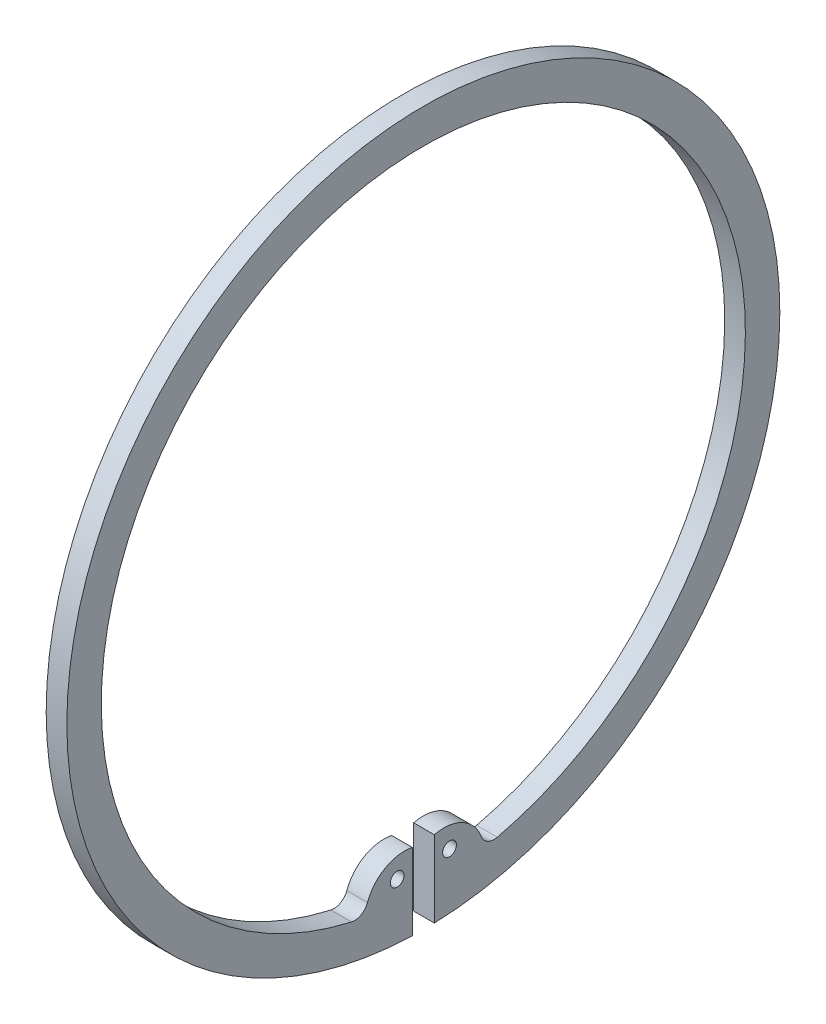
ISO-10303-21;
HEADER;
FILE_DESCRIPTION(('STEP AP214'),'2;1');
FILE_NAME('part.step','',(''),(''),'','','');
FILE_SCHEMA(('AUTOMOTIVE_DESIGN { 1 0 10303 214 1 1 1 1 }'));
ENDSEC;
DATA;
#1=APPLICATION_CONTEXT('core data for automotive mechanical design processes');
#2=APPLICATION_PROTOCOL_DEFINITION('international standard','automotive_design',2000,#1);
#3=PRODUCT_CONTEXT('',#1,'mechanical');
#4=PRODUCT('Part','Part','',(#3));
#5=PRODUCT_RELATED_PRODUCT_CATEGORY('part','',(#4));
#6=PRODUCT_DEFINITION_FORMATION('','',#4);
#7=PRODUCT_DEFINITION_CONTEXT('part definition',#1,'design');
#8=PRODUCT_DEFINITION('design','',#6,#7);
#9=PRODUCT_DEFINITION_SHAPE('','',#8);
#10=(LENGTH_UNIT() NAMED_UNIT(*) SI_UNIT(.MILLI.,.METRE.));
#11=(NAMED_UNIT(*) PLANE_ANGLE_UNIT() SI_UNIT($,.RADIAN.));
#12=(NAMED_UNIT(*) SI_UNIT($,.STERADIAN.) SOLID_ANGLE_UNIT());
#13=UNCERTAINTY_MEASURE_WITH_UNIT(LENGTH_MEASURE(1.E-05),#10,'distance_accuracy_value','');
#14=(GEOMETRIC_REPRESENTATION_CONTEXT(3) GLOBAL_UNCERTAINTY_ASSIGNED_CONTEXT((#13)) GLOBAL_UNIT_ASSIGNED_CONTEXT((#10,
#11,#12)) REPRESENTATION_CONTEXT('',''));
#15=CARTESIAN_POINT('',(0.,0.,0.));
#16=DIRECTION('',(0.,0.,1.));
#17=DIRECTION('',(1.,0.,0.));
#18=AXIS2_PLACEMENT_3D('',#15,#16,#17);
#19=CARTESIAN_POINT('',(3.,-43.6206369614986,9.99012167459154));
#20=DIRECTION('',(1.,0.,0.));
#21=DIRECTION('',(0.,0.,-1.));
#22=AXIS2_PLACEMENT_3D('',#19,#20,#21);
#23=PLANE('',#22);
#24=CARTESIAN_POINT('',(3.,-43.5,3.79999999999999));
#25=DIRECTION('',(1.,0.,0.));
#26=DIRECTION('',(0.,0.,1.));
#27=AXIS2_PLACEMENT_3D('',#24,#25,#26);
#28=CIRCLE('',#27,1.);
#29=CARTESIAN_POINT('',(3.,-43.5,4.8));
#30=VERTEX_POINT('',#29);
#31=EDGE_CURVE('E115',#30,#30,#28,.T.);
#32=ORIENTED_EDGE('',*,*,#31,.F.);
#33=EDGE_LOOP('',(#32));
#34=FACE_BOUND('',#33,.T.);
#35=CARTESIAN_POINT('',(3.,-43.6206369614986,9.99012167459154));
#36=DIRECTION('',(-1.,0.,0.));
#37=DIRECTION('',(0.,0.,-1.));
#38=AXIS2_PLACEMENT_3D('',#35,#36,#37);
#39=CIRCLE('',#38,2.);
#40=CARTESIAN_POINT('',(3.,-44.2946812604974,8.1071282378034));
#41=VERTEX_POINT('',#40);
#42=CARTESIAN_POINT('',(3.,-45.5701626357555,10.4366075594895));
#43=VERTEX_POINT('',#42);
#44=EDGE_CURVE('E133',#41,#43,#39,.T.);
#45=ORIENTED_EDGE('',*,*,#44,.T.);
#46=CARTESIAN_POINT('',(3.,0.,0.));
#47=DIRECTION('',(-1.,0.,0.));
#48=DIRECTION('',(0.,0.,-1.));
#49=AXIS2_PLACEMENT_3D('',#46,#47,#48);
#50=CIRCLE('',#49,46.75);
#51=CARTESIAN_POINT('',(3.,-45.4992757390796,-10.7414341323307));
#52=VERTEX_POINT('',#51);
#53=EDGE_CURVE('E110',#43,#52,#50,.T.);
#54=ORIENTED_EDGE('',*,*,#53,.T.);
#55=CARTESIAN_POINT('',(3.,-43.5527826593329,-10.2819075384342));
#56=DIRECTION('',(-1.,0.,0.));
#57=DIRECTION('',(0.,0.,-1.));
#58=AXIS2_PLACEMENT_3D('',#55,#56,#57);
#59=CIRCLE('',#58,2.);
#60=CARTESIAN_POINT('',(3.,-44.239979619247,-8.40367423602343));
#61=VERTEX_POINT('',#60);
#62=EDGE_CURVE('E136',#52,#61,#59,.T.);
#63=ORIENTED_EDGE('',*,*,#62,.T.);
#64=CARTESIAN_POINT('',(3.,-46.2238504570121,-2.98139722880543));
#65=DIRECTION('',(1.,0.,0.));
#66=DIRECTION('',(0.,0.,1.));
#67=AXIS2_PLACEMENT_3D('',#64,#65,#66);
#68=CIRCLE('',#67,5.77380562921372);
#69=CARTESIAN_POINT('',(3.,-40.6177311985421,-1.6));
#70=VERTEX_POINT('',#69);
#71=EDGE_CURVE('E138',#61,#70,#68,.T.);
#72=ORIENTED_EDGE('',*,*,#71,.T.);
#73=DIRECTION('',(0.,-1.,0.));
#74=VECTOR('',#73,1.);
#75=CARTESIAN_POINT('',(3.,-51.7252597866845,-1.6));
#76=LINE('',#75,#74);
#77=CARTESIAN_POINT('',(3.,-51.7252597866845,-1.6));
#78=VERTEX_POINT('',#77);
#79=EDGE_CURVE('E140',#70,#78,#76,.T.);
#80=ORIENTED_EDGE('',*,*,#79,.T.);
#81=CARTESIAN_POINT('',(3.,0.,0.));
#82=DIRECTION('',(1.,0.,0.));
#83=DIRECTION('',(0.,0.,-1.));
#84=AXIS2_PLACEMENT_3D('',#81,#82,#83);
#85=CIRCLE('',#84,51.75);
#86=CARTESIAN_POINT('',(3.,-51.7252597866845,1.60000000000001));
#87=VERTEX_POINT('',#86);
#88=EDGE_CURVE('E142',#78,#87,#85,.T.);
#89=ORIENTED_EDGE('',*,*,#88,.T.);
#90=DIRECTION('',(0.,1.,0.));
#91=VECTOR('',#90,1.);
#92=CARTESIAN_POINT('',(3.,-51.7252597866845,1.6));
#93=LINE('',#92,#91);
#94=CARTESIAN_POINT('',(3.,-40.6091600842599,1.6));
#95=VERTEX_POINT('',#94);
#96=EDGE_CURVE('E51',#87,#95,#93,.T.);
#97=ORIENTED_EDGE('',*,*,#96,.T.);
#98=CARTESIAN_POINT('',(3.,-46.2241371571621,2.71704809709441));
#99=DIRECTION('',(1.,0.,0.));
#100=DIRECTION('',(0.,0.,1.));
#101=AXIS2_PLACEMENT_3D('',#98,#99,#100);
#102=CIRCLE('',#101,5.72501213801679);
#103=EDGE_CURVE('E46',#95,#41,#102,.T.);
#104=ORIENTED_EDGE('',*,*,#103,.T.);
#105=EDGE_LOOP('',(#45,#54,#63,#72,#80,#89,#97,#104));
#106=FACE_BOUND('',#105,.T.);
#107=CARTESIAN_POINT('',(3.,-43.5,-3.8));
#108=DIRECTION('',(1.,0.,0.));
#109=DIRECTION('',(0.,0.,1.));
#110=AXIS2_PLACEMENT_3D('',#107,#108,#109);
#111=CIRCLE('',#110,1.);
#112=CARTESIAN_POINT('',(3.,-43.5,-2.8));
#113=VERTEX_POINT('',#112);
#114=EDGE_CURVE('E213',#113,#113,#111,.T.);
#115=ORIENTED_EDGE('',*,*,#114,.F.);
#116=EDGE_LOOP('',(#115));
#117=FACE_BOUND('',#116,.T.);
#118=ADVANCED_FACE('F31',(#34,#106,#117),#23,.T.);
#119=CARTESIAN_POINT('',(0.,-43.6206369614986,9.99012167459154));
#120=DIRECTION('',(1.,0.,0.));
#121=DIRECTION('',(0.,0.,-1.));
#122=AXIS2_PLACEMENT_3D('',#119,#120,#121);
#123=PLANE('',#122);
#124=CARTESIAN_POINT('',(0.,-43.5,3.79999999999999));
#125=DIRECTION('',(1.,0.,0.));
#126=DIRECTION('',(0.,0.,1.));
#127=AXIS2_PLACEMENT_3D('',#124,#125,#126);
#128=CIRCLE('',#127,1.);
#129=CARTESIAN_POINT('',(0.,-43.5,4.8));
#130=VERTEX_POINT('',#129);
#131=EDGE_CURVE('E118',#130,#130,#128,.T.);
#132=ORIENTED_EDGE('',*,*,#131,.T.);
#133=EDGE_LOOP('',(#132));
#134=FACE_BOUND('',#133,.T.);
#135=CARTESIAN_POINT('',(0.,-43.6206369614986,9.99012167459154));
#136=DIRECTION('',(-1.,0.,0.));
#137=DIRECTION('',(0.,0.,-1.));
#138=AXIS2_PLACEMENT_3D('',#135,#136,#137);
#139=CIRCLE('',#138,2.);
#140=CARTESIAN_POINT('',(0.,-44.2946812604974,8.1071282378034));
#141=VERTEX_POINT('',#140);
#142=CARTESIAN_POINT('',(0.,-45.5701626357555,10.4366075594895));
#143=VERTEX_POINT('',#142);
#144=EDGE_CURVE('E101',#141,#143,#139,.T.);
#145=ORIENTED_EDGE('',*,*,#144,.F.);
#146=CARTESIAN_POINT('',(0.,-46.2241371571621,2.71704809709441));
#147=DIRECTION('',(1.,0.,0.));
#148=DIRECTION('',(0.,0.,1.));
#149=AXIS2_PLACEMENT_3D('',#146,#147,#148);
#150=CIRCLE('',#149,5.72501213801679);
#151=CARTESIAN_POINT('',(0.,-40.6091600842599,1.6));
#152=VERTEX_POINT('',#151);
#153=EDGE_CURVE('E131',#152,#141,#150,.T.);
#154=ORIENTED_EDGE('',*,*,#153,.F.);
#155=DIRECTION('',(0.,1.,0.));
#156=VECTOR('',#155,1.);
#157=CARTESIAN_POINT('',(0.,-51.7252597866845,1.6));
#158=LINE('',#157,#156);
#159=CARTESIAN_POINT('',(0.,-51.7252597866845,1.60000000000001));
#160=VERTEX_POINT('',#159);
#161=EDGE_CURVE('E129',#160,#152,#158,.T.);
#162=ORIENTED_EDGE('',*,*,#161,.F.);
#163=CARTESIAN_POINT('',(0.,0.,0.));
#164=DIRECTION('',(1.,0.,0.));
#165=DIRECTION('',(0.,0.,-1.));
#166=AXIS2_PLACEMENT_3D('',#163,#164,#165);
#167=CIRCLE('',#166,51.75);
#168=CARTESIAN_POINT('',(0.,-51.7252597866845,-1.6));
#169=VERTEX_POINT('',#168);
#170=EDGE_CURVE('E127',#169,#160,#167,.T.);
#171=ORIENTED_EDGE('',*,*,#170,.F.);
#172=DIRECTION('',(0.,-1.,0.));
#173=VECTOR('',#172,1.);
#174=CARTESIAN_POINT('',(0.,-51.7252597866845,-1.6));
#175=LINE('',#174,#173);
#176=CARTESIAN_POINT('',(0.,-40.6177311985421,-1.6));
#177=VERTEX_POINT('',#176);
#178=EDGE_CURVE('E125',#177,#169,#175,.T.);
#179=ORIENTED_EDGE('',*,*,#178,.F.);
#180=CARTESIAN_POINT('',(0.,-46.2238504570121,-2.98139722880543));
#181=DIRECTION('',(1.,0.,0.));
#182=DIRECTION('',(0.,0.,1.));
#183=AXIS2_PLACEMENT_3D('',#180,#181,#182);
#184=CIRCLE('',#183,5.77380562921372);
#185=CARTESIAN_POINT('',(0.,-44.239979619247,-8.40367423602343));
#186=VERTEX_POINT('',#185);
#187=EDGE_CURVE('E123',#186,#177,#184,.T.);
#188=ORIENTED_EDGE('',*,*,#187,.F.);
#189=CARTESIAN_POINT('',(0.,-43.5527826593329,-10.2819075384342));
#190=DIRECTION('',(-1.,0.,0.));
#191=DIRECTION('',(0.,0.,-1.));
#192=AXIS2_PLACEMENT_3D('',#189,#190,#191);
#193=CIRCLE('',#192,2.);
#194=CARTESIAN_POINT('',(0.,-45.4992757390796,-10.7414341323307));
#195=VERTEX_POINT('',#194);
#196=EDGE_CURVE('E103',#195,#186,#193,.T.);
#197=ORIENTED_EDGE('',*,*,#196,.F.);
#198=CARTESIAN_POINT('',(0.,0.,0.));
#199=DIRECTION('',(-1.,0.,0.));
#200=DIRECTION('',(0.,0.,-1.));
#201=AXIS2_PLACEMENT_3D('',#198,#199,#200);
#202=CIRCLE('',#201,46.75);
#203=EDGE_CURVE('E96',#143,#195,#202,.T.);
#204=ORIENTED_EDGE('',*,*,#203,.F.);
#205=EDGE_LOOP('',(#145,#154,#162,#171,#179,#188,#197,#204));
#206=FACE_BOUND('',#205,.T.);
#207=CARTESIAN_POINT('',(0.,-43.5,-3.8));
#208=DIRECTION('',(1.,0.,0.));
#209=DIRECTION('',(0.,0.,1.));
#210=AXIS2_PLACEMENT_3D('',#207,#208,#209);
#211=CIRCLE('',#210,1.);
#212=CARTESIAN_POINT('',(0.,-43.5,-2.8));
#213=VERTEX_POINT('',#212);
#214=EDGE_CURVE('E216',#213,#213,#211,.T.);
#215=ORIENTED_EDGE('',*,*,#214,.T.);
#216=EDGE_LOOP('',(#215));
#217=FACE_BOUND('',#216,.T.);
#218=ADVANCED_FACE('F97',(#134,#206,#217),#123,.F.);
#219=CARTESIAN_POINT('',(3.,-43.6206369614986,9.99012167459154));
#220=DIRECTION('',(-1.,0.,0.));
#221=DIRECTION('',(0.,0.,1.));
#222=AXIS2_PLACEMENT_3D('',#219,#220,#221);
#223=CYLINDRICAL_SURFACE('',#222,2.);
#224=ORIENTED_EDGE('',*,*,#144,.T.);
#225=DIRECTION('',(-1.,0.,0.));
#226=VECTOR('',#225,1.);
#227=CARTESIAN_POINT('',(3.,-45.5701626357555,10.4366075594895));
#228=LINE('',#227,#226);
#229=EDGE_CURVE('E11',#43,#143,#228,.T.);
#230=ORIENTED_EDGE('',*,*,#229,.F.);
#231=ORIENTED_EDGE('',*,*,#44,.F.);
#232=DIRECTION('',(-1.,0.,0.));
#233=VECTOR('',#232,1.);
#234=CARTESIAN_POINT('',(3.,-44.2946812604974,8.1071282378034));
#235=LINE('',#234,#233);
#236=EDGE_CURVE('E114',#41,#141,#235,.T.);
#237=ORIENTED_EDGE('',*,*,#236,.T.);
#238=EDGE_LOOP('',(#224,#230,#231,#237));
#239=FACE_BOUND('',#238,.T.);
#240=ADVANCED_FACE('F33',(#239),#223,.F.);
#241=CARTESIAN_POINT('',(3.,0.,0.));
#242=DIRECTION('',(-1.,0.,0.));
#243=DIRECTION('',(0.,0.,1.));
#244=AXIS2_PLACEMENT_3D('',#241,#242,#243);
#245=CYLINDRICAL_SURFACE('',#244,46.75);
#246=ORIENTED_EDGE('',*,*,#203,.T.);
#247=DIRECTION('',(-1.,0.,0.));
#248=VECTOR('',#247,1.);
#249=CARTESIAN_POINT('',(3.,-45.4992757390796,-10.7414341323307));
#250=LINE('',#249,#248);
#251=EDGE_CURVE('E39',#52,#195,#250,.T.);
#252=ORIENTED_EDGE('',*,*,#251,.F.);
#253=ORIENTED_EDGE('',*,*,#53,.F.);
#254=ORIENTED_EDGE('',*,*,#229,.T.);
#255=EDGE_LOOP('',(#246,#252,#253,#254));
#256=FACE_BOUND('',#255,.T.);
#257=ADVANCED_FACE('F109',(#256),#245,.F.);
#258=CARTESIAN_POINT('',(3.,-43.5527826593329,-10.2819075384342));
#259=DIRECTION('',(-1.,0.,0.));
#260=DIRECTION('',(0.,0.,1.));
#261=AXIS2_PLACEMENT_3D('',#258,#259,#260);
#262=CYLINDRICAL_SURFACE('',#261,2.);
#263=ORIENTED_EDGE('',*,*,#196,.T.);
#264=DIRECTION('',(-1.,0.,0.));
#265=VECTOR('',#264,1.);
#266=CARTESIAN_POINT('',(3.,-44.239979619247,-8.40367423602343));
#267=LINE('',#266,#265);
#268=EDGE_CURVE('E159',#61,#186,#267,.T.);
#269=ORIENTED_EDGE('',*,*,#268,.F.);
#270=ORIENTED_EDGE('',*,*,#62,.F.);
#271=ORIENTED_EDGE('',*,*,#251,.T.);
#272=EDGE_LOOP('',(#263,#269,#270,#271));
#273=FACE_BOUND('',#272,.T.);
#274=ADVANCED_FACE('F163',(#273),#262,.F.);
#275=CARTESIAN_POINT('',(3.,-46.2238504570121,-2.98139722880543));
#276=DIRECTION('',(-1.,0.,0.));
#277=DIRECTION('',(0.,0.,1.));
#278=AXIS2_PLACEMENT_3D('',#275,#276,#277);
#279=CYLINDRICAL_SURFACE('',#278,5.77380562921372);
#280=ORIENTED_EDGE('',*,*,#187,.T.);
#281=DIRECTION('',(-1.,0.,0.));
#282=VECTOR('',#281,1.);
#283=CARTESIAN_POINT('',(3.,-40.6177311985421,-1.6));
#284=LINE('',#283,#282);
#285=EDGE_CURVE('E156',#70,#177,#284,.T.);
#286=ORIENTED_EDGE('',*,*,#285,.F.);
#287=ORIENTED_EDGE('',*,*,#71,.F.);
#288=ORIENTED_EDGE('',*,*,#268,.T.);
#289=EDGE_LOOP('',(#280,#286,#287,#288));
#290=FACE_BOUND('',#289,.T.);
#291=ADVANCED_FACE('F171',(#290),#279,.T.);
#292=CARTESIAN_POINT('',(3.,-51.7252597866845,-1.6));
#293=DIRECTION('',(0.,0.,-1.));
#294=DIRECTION('',(-1.,0.,0.));
#295=AXIS2_PLACEMENT_3D('',#292,#293,#294);
#296=PLANE('',#295);
#297=ORIENTED_EDGE('',*,*,#178,.T.);
#298=DIRECTION('',(-1.,0.,0.));
#299=VECTOR('',#298,1.);
#300=CARTESIAN_POINT('',(3.,-51.7252597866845,-1.6));
#301=LINE('',#300,#299);
#302=EDGE_CURVE('E153',#78,#169,#301,.T.);
#303=ORIENTED_EDGE('',*,*,#302,.F.);
#304=ORIENTED_EDGE('',*,*,#79,.F.);
#305=ORIENTED_EDGE('',*,*,#285,.T.);
#306=EDGE_LOOP('',(#297,#303,#304,#305));
#307=FACE_BOUND('',#306,.T.);
#308=ADVANCED_FACE('F174',(#307),#296,.F.);
#309=CARTESIAN_POINT('',(3.,0.,0.));
#310=DIRECTION('',(-1.,0.,0.));
#311=DIRECTION('',(0.,0.,1.));
#312=AXIS2_PLACEMENT_3D('',#309,#310,#311);
#313=CYLINDRICAL_SURFACE('',#312,51.75);
#314=ORIENTED_EDGE('',*,*,#170,.T.);
#315=DIRECTION('',(-1.,0.,0.));
#316=VECTOR('',#315,1.);
#317=CARTESIAN_POINT('',(3.,-51.7252597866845,1.60000000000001));
#318=LINE('',#317,#316);
#319=EDGE_CURVE('E150',#87,#160,#318,.T.);
#320=ORIENTED_EDGE('',*,*,#319,.F.);
#321=ORIENTED_EDGE('',*,*,#88,.F.);
#322=ORIENTED_EDGE('',*,*,#302,.T.);
#323=EDGE_LOOP('',(#314,#320,#321,#322));
#324=FACE_BOUND('',#323,.T.);
#325=ADVANCED_FACE('F179',(#324),#313,.T.);
#326=CARTESIAN_POINT('',(3.,-51.7252597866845,1.6));
#327=DIRECTION('',(0.,0.,1.));
#328=DIRECTION('',(1.,0.,0.));
#329=AXIS2_PLACEMENT_3D('',#326,#327,#328);
#330=PLANE('',#329);
#331=ORIENTED_EDGE('',*,*,#161,.T.);
#332=DIRECTION('',(-1.,0.,0.));
#333=VECTOR('',#332,1.);
#334=CARTESIAN_POINT('',(3.,-40.6091600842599,1.6));
#335=LINE('',#334,#333);
#336=EDGE_CURVE('E147',#95,#152,#335,.T.);
#337=ORIENTED_EDGE('',*,*,#336,.F.);
#338=ORIENTED_EDGE('',*,*,#96,.F.);
#339=ORIENTED_EDGE('',*,*,#319,.T.);
#340=EDGE_LOOP('',(#331,#337,#338,#339));
#341=FACE_BOUND('',#340,.T.);
#342=ADVANCED_FACE('F182',(#341),#330,.F.);
#343=CARTESIAN_POINT('',(3.,-46.2241371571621,2.71704809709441));
#344=DIRECTION('',(-1.,0.,0.));
#345=DIRECTION('',(0.,0.,1.));
#346=AXIS2_PLACEMENT_3D('',#343,#344,#345);
#347=CYLINDRICAL_SURFACE('',#346,5.72501213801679);
#348=ORIENTED_EDGE('',*,*,#153,.T.);
#349=ORIENTED_EDGE('',*,*,#236,.F.);
#350=ORIENTED_EDGE('',*,*,#103,.F.);
#351=ORIENTED_EDGE('',*,*,#336,.T.);
#352=EDGE_LOOP('',(#348,#349,#350,#351));
#353=FACE_BOUND('',#352,.T.);
#354=ADVANCED_FACE('F184',(#353),#347,.T.);
#355=CARTESIAN_POINT('',(3.,-43.5,3.79999999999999));
#356=DIRECTION('',(-1.,0.,0.));
#357=DIRECTION('',(0.,0.,1.));
#358=AXIS2_PLACEMENT_3D('',#355,#356,#357);
#359=CYLINDRICAL_SURFACE('',#358,1.);
#360=ORIENTED_EDGE('',*,*,#31,.T.);
#361=EDGE_LOOP('',(#360));
#362=FACE_BOUND('',#361,.T.);
#363=ORIENTED_EDGE('',*,*,#131,.F.);
#364=EDGE_LOOP('',(#363));
#365=FACE_BOUND('',#364,.T.);
#366=ADVANCED_FACE('F186',(#362,#365),#359,.F.);
#367=CARTESIAN_POINT('',(3.,-43.5,-3.8));
#368=DIRECTION('',(-1.,0.,0.));
#369=DIRECTION('',(0.,0.,1.));
#370=AXIS2_PLACEMENT_3D('',#367,#368,#369);
#371=CYLINDRICAL_SURFACE('',#370,1.);
#372=ORIENTED_EDGE('',*,*,#114,.T.);
#373=EDGE_LOOP('',(#372));
#374=FACE_BOUND('',#373,.T.);
#375=ORIENTED_EDGE('',*,*,#214,.F.);
#376=EDGE_LOOP('',(#375));
#377=FACE_BOUND('',#376,.T.);
#378=ADVANCED_FACE('F192',(#374,#377),#371,.F.);
#379=CLOSED_SHELL('',(#118,#218,#240,#257,#274,#291,#308,#325,#342,#354,#366,#378));
#380=MANIFOLD_SOLID_BREP('B2',#379);
#381=ADVANCED_BREP_SHAPE_REPRESENTATION('',(#18,#380),#14);
#382=SHAPE_DEFINITION_REPRESENTATION(#9,#381);
ENDSEC;
END-ISO-10303-21;
